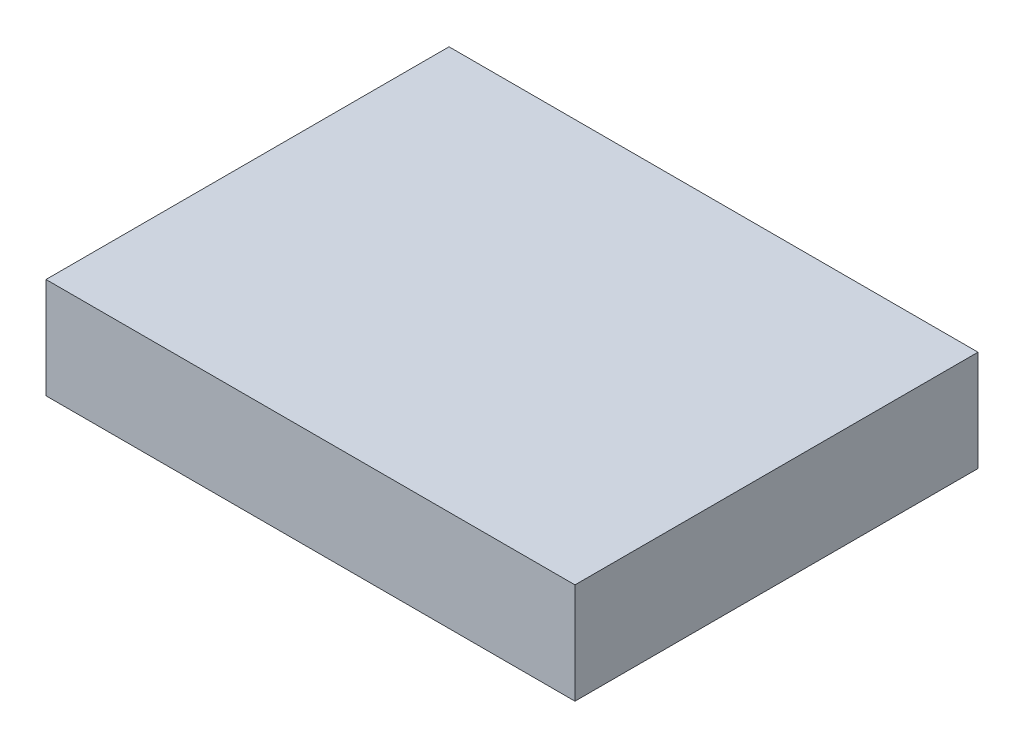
ISO-10303-21;
HEADER;
FILE_DESCRIPTION(('STEP AP214'),'2;1');
FILE_NAME('part.step','',(''),(''),'','','');
FILE_SCHEMA(('AUTOMOTIVE_DESIGN { 1 0 10303 214 1 1 1 1 }'));
ENDSEC;
DATA;
#1=APPLICATION_CONTEXT('core data for automotive mechanical design processes');
#2=APPLICATION_PROTOCOL_DEFINITION('international standard','automotive_design',2000,#1);
#3=PRODUCT_CONTEXT('',#1,'mechanical');
#4=PRODUCT('Part','Part','',(#3));
#5=PRODUCT_RELATED_PRODUCT_CATEGORY('part','',(#4));
#6=PRODUCT_DEFINITION_FORMATION('','',#4);
#7=PRODUCT_DEFINITION_CONTEXT('part definition',#1,'design');
#8=PRODUCT_DEFINITION('design','',#6,#7);
#9=PRODUCT_DEFINITION_SHAPE('','',#8);
#10=(LENGTH_UNIT() NAMED_UNIT(*) SI_UNIT(.MILLI.,.METRE.));
#11=(NAMED_UNIT(*) PLANE_ANGLE_UNIT() SI_UNIT($,.RADIAN.));
#12=(NAMED_UNIT(*) SI_UNIT($,.STERADIAN.) SOLID_ANGLE_UNIT());
#13=UNCERTAINTY_MEASURE_WITH_UNIT(LENGTH_MEASURE(1.E-05),#10,'distance_accuracy_value','');
#14=(GEOMETRIC_REPRESENTATION_CONTEXT(3) GLOBAL_UNCERTAINTY_ASSIGNED_CONTEXT((#13)) GLOBAL_UNIT_ASSIGNED_CONTEXT((#10,
#11,#12)) REPRESENTATION_CONTEXT('',''));
#15=CARTESIAN_POINT('',(0.,0.,0.));
#16=DIRECTION('',(0.,0.,1.));
#17=DIRECTION('',(1.,0.,0.));
#18=AXIS2_PLACEMENT_3D('',#15,#16,#17);
#19=CARTESIAN_POINT('',(-5.25,2.,4.));
#20=DIRECTION('',(-1.,0.,0.));
#21=DIRECTION('',(0.,0.,1.));
#22=AXIS2_PLACEMENT_3D('',#19,#20,#21);
#23=PLANE('',#22);
#24=DIRECTION('',(0.,0.,-1.));
#25=VECTOR('',#24,1.);
#26=CARTESIAN_POINT('',(-5.25,0.,4.));
#27=LINE('',#26,#25);
#28=CARTESIAN_POINT('',(-5.25,0.,4.));
#29=VERTEX_POINT('',#28);
#30=CARTESIAN_POINT('',(-5.25,0.,-4.));
#31=VERTEX_POINT('',#30);
#32=EDGE_CURVE('E222',#29,#31,#27,.T.);
#33=ORIENTED_EDGE('',*,*,#32,.F.);
#34=DIRECTION('',(0.,-1.,0.));
#35=VECTOR('',#34,1.);
#36=CARTESIAN_POINT('',(-5.25,2.,4.));
#37=LINE('',#36,#35);
#38=CARTESIAN_POINT('',(-5.25,2.,4.));
#39=VERTEX_POINT('',#38);
#40=EDGE_CURVE('E11',#39,#29,#37,.T.);
#41=ORIENTED_EDGE('',*,*,#40,.F.);
#42=DIRECTION('',(0.,0.,-1.));
#43=VECTOR('',#42,1.);
#44=CARTESIAN_POINT('',(-5.25,2.,4.));
#45=LINE('',#44,#43);
#46=CARTESIAN_POINT('',(-5.25,2.,-4.));
#47=VERTEX_POINT('',#46);
#48=EDGE_CURVE('E357',#39,#47,#45,.T.);
#49=ORIENTED_EDGE('',*,*,#48,.T.);
#50=DIRECTION('',(0.,-1.,0.));
#51=VECTOR('',#50,1.);
#52=CARTESIAN_POINT('',(-5.25,2.,-4.));
#53=LINE('',#52,#51);
#54=EDGE_CURVE('E41',#47,#31,#53,.T.);
#55=ORIENTED_EDGE('',*,*,#54,.T.);
#56=EDGE_LOOP('',(#33,#41,#49,#55));
#57=FACE_BOUND('',#56,.T.);
#58=ADVANCED_FACE('F38',(#57),#23,.T.);
#59=CARTESIAN_POINT('',(-5.25,2.,4.));
#60=DIRECTION('',(0.,0.,-1.));
#61=DIRECTION('',(-1.,0.,0.));
#62=AXIS2_PLACEMENT_3D('',#59,#60,#61);
#63=PLANE('',#62);
#64=DIRECTION('',(1.,0.,0.));
#65=VECTOR('',#64,1.);
#66=CARTESIAN_POINT('',(-5.25,0.,4.));
#67=LINE('',#66,#65);
#68=CARTESIAN_POINT('',(5.25,0.,4.));
#69=VERTEX_POINT('',#68);
#70=EDGE_CURVE('E362',#29,#69,#67,.T.);
#71=ORIENTED_EDGE('',*,*,#70,.T.);
#72=DIRECTION('',(0.,-1.,0.));
#73=VECTOR('',#72,1.);
#74=CARTESIAN_POINT('',(5.25,2.,4.));
#75=LINE('',#74,#73);
#76=CARTESIAN_POINT('',(5.25,2.,4.));
#77=VERTEX_POINT('',#76);
#78=EDGE_CURVE('E47',#77,#69,#75,.T.);
#79=ORIENTED_EDGE('',*,*,#78,.F.);
#80=DIRECTION('',(1.,0.,0.));
#81=VECTOR('',#80,1.);
#82=CARTESIAN_POINT('',(-5.25,2.,4.));
#83=LINE('',#82,#81);
#84=EDGE_CURVE('E369',#39,#77,#83,.T.);
#85=ORIENTED_EDGE('',*,*,#84,.F.);
#86=ORIENTED_EDGE('',*,*,#40,.T.);
#87=EDGE_LOOP('',(#71,#79,#85,#86));
#88=FACE_BOUND('',#87,.T.);
#89=ADVANCED_FACE('F404',(#88),#63,.F.);
#90=CARTESIAN_POINT('',(5.25,2.,4.));
#91=DIRECTION('',(-1.,0.,0.));
#92=DIRECTION('',(0.,0.,1.));
#93=AXIS2_PLACEMENT_3D('',#90,#91,#92);
#94=PLANE('',#93);
#95=DIRECTION('',(0.,0.,-1.));
#96=VECTOR('',#95,1.);
#97=CARTESIAN_POINT('',(5.25,0.,4.));
#98=LINE('',#97,#96);
#99=CARTESIAN_POINT('',(5.25,0.,-4.));
#100=VERTEX_POINT('',#99);
#101=EDGE_CURVE('E379',#69,#100,#98,.T.);
#102=ORIENTED_EDGE('',*,*,#101,.T.);
#103=DIRECTION('',(0.,-1.,0.));
#104=VECTOR('',#103,1.);
#105=CARTESIAN_POINT('',(5.25,2.,-4.));
#106=LINE('',#105,#104);
#107=CARTESIAN_POINT('',(5.25,2.,-4.));
#108=VERTEX_POINT('',#107);
#109=EDGE_CURVE('E387',#108,#100,#106,.T.);
#110=ORIENTED_EDGE('',*,*,#109,.F.);
#111=DIRECTION('',(0.,0.,-1.));
#112=VECTOR('',#111,1.);
#113=CARTESIAN_POINT('',(5.25,2.,4.));
#114=LINE('',#113,#112);
#115=EDGE_CURVE('E366',#77,#108,#114,.T.);
#116=ORIENTED_EDGE('',*,*,#115,.F.);
#117=ORIENTED_EDGE('',*,*,#78,.T.);
#118=EDGE_LOOP('',(#102,#110,#116,#117));
#119=FACE_BOUND('',#118,.T.);
#120=ADVANCED_FACE('F408',(#119),#94,.F.);
#121=CARTESIAN_POINT('',(-5.25,2.,-4.));
#122=DIRECTION('',(0.,0.,-1.));
#123=DIRECTION('',(-1.,0.,0.));
#124=AXIS2_PLACEMENT_3D('',#121,#122,#123);
#125=PLANE('',#124);
#126=DIRECTION('',(0.,-1.,0.));
#127=VECTOR('',#126,1.);
#128=CARTESIAN_POINT('',(4.375,1.625,-4.));
#129=LINE('',#128,#127);
#130=CARTESIAN_POINT('',(4.375,1.625,-4.));
#131=VERTEX_POINT('',#130);
#132=CARTESIAN_POINT('',(4.375,0.375000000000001,-4.));
#133=VERTEX_POINT('',#132);
#134=EDGE_CURVE('E55',#131,#133,#129,.T.);
#135=ORIENTED_EDGE('',*,*,#134,.F.);
#136=DIRECTION('',(1.,0.,0.));
#137=VECTOR('',#136,1.);
#138=CARTESIAN_POINT('',(4.375,1.625,-4.));
#139=LINE('',#138,#137);
#140=CARTESIAN_POINT('',(3.125,1.625,-4.));
#141=VERTEX_POINT('',#140);
#142=EDGE_CURVE('E199',#141,#131,#139,.T.);
#143=ORIENTED_EDGE('',*,*,#142,.F.);
#144=DIRECTION('',(0.,1.,0.));
#145=VECTOR('',#144,1.);
#146=CARTESIAN_POINT('',(3.125,1.625,-4.));
#147=LINE('',#146,#145);
#148=CARTESIAN_POINT('',(3.125,0.375000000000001,-4.));
#149=VERTEX_POINT('',#148);
#150=EDGE_CURVE('E203',#149,#141,#147,.T.);
#151=ORIENTED_EDGE('',*,*,#150,.F.);
#152=DIRECTION('',(-1.,0.,0.));
#153=VECTOR('',#152,1.);
#154=CARTESIAN_POINT('',(4.375,0.375000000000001,-4.));
#155=LINE('',#154,#153);
#156=EDGE_CURVE('E212',#133,#149,#155,.T.);
#157=ORIENTED_EDGE('',*,*,#156,.F.);
#158=EDGE_LOOP('',(#135,#143,#151,#157));
#159=FACE_BOUND('',#158,.T.);
#160=DIRECTION('',(0.,-1.,0.));
#161=VECTOR('',#160,1.);
#162=CARTESIAN_POINT('',(1.875,1.625,-4.));
#163=LINE('',#162,#161);
#164=CARTESIAN_POINT('',(1.875,1.625,-4.));
#165=VERTEX_POINT('',#164);
#166=CARTESIAN_POINT('',(1.875,0.375000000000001,-4.));
#167=VERTEX_POINT('',#166);
#168=EDGE_CURVE('E63',#165,#167,#163,.T.);
#169=ORIENTED_EDGE('',*,*,#168,.F.);
#170=DIRECTION('',(1.,0.,0.));
#171=VECTOR('',#170,1.);
#172=CARTESIAN_POINT('',(1.875,1.625,-4.));
#173=LINE('',#172,#171);
#174=CARTESIAN_POINT('',(0.625,1.625,-4.));
#175=VERTEX_POINT('',#174);
#176=EDGE_CURVE('E233',#175,#165,#173,.T.);
#177=ORIENTED_EDGE('',*,*,#176,.F.);
#178=DIRECTION('',(0.,1.,0.));
#179=VECTOR('',#178,1.);
#180=CARTESIAN_POINT('',(0.625,1.625,-4.));
#181=LINE('',#180,#179);
#182=CARTESIAN_POINT('',(0.625,0.375000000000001,-4.));
#183=VERTEX_POINT('',#182);
#184=EDGE_CURVE('E253',#183,#175,#181,.T.);
#185=ORIENTED_EDGE('',*,*,#184,.F.);
#186=DIRECTION('',(-1.,0.,0.));
#187=VECTOR('',#186,1.);
#188=CARTESIAN_POINT('',(1.875,0.375000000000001,-4.));
#189=LINE('',#188,#187);
#190=EDGE_CURVE('E248',#167,#183,#189,.T.);
#191=ORIENTED_EDGE('',*,*,#190,.F.);
#192=EDGE_LOOP('',(#169,#177,#185,#191));
#193=FACE_BOUND('',#192,.T.);
#194=DIRECTION('',(1.,0.,0.));
#195=VECTOR('',#194,1.);
#196=CARTESIAN_POINT('',(-1.875,1.625,-4.));
#197=LINE('',#196,#195);
#198=CARTESIAN_POINT('',(-1.875,1.625,-4.));
#199=VERTEX_POINT('',#198);
#200=CARTESIAN_POINT('',(-0.625,1.625,-4.));
#201=VERTEX_POINT('',#200);
#202=EDGE_CURVE('E288',#199,#201,#197,.T.);
#203=ORIENTED_EDGE('',*,*,#202,.F.);
#204=DIRECTION('',(0.,1.,0.));
#205=VECTOR('',#204,1.);
#206=CARTESIAN_POINT('',(-1.875,1.625,-4.));
#207=LINE('',#206,#205);
#208=CARTESIAN_POINT('',(-1.875,0.375000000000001,-4.));
#209=VERTEX_POINT('',#208);
#210=EDGE_CURVE('E275',#209,#199,#207,.T.);
#211=ORIENTED_EDGE('',*,*,#210,.F.);
#212=DIRECTION('',(-1.,0.,0.));
#213=VECTOR('',#212,1.);
#214=CARTESIAN_POINT('',(-1.875,0.375000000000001,-4.));
#215=LINE('',#214,#213);
#216=CARTESIAN_POINT('',(-0.625,0.375000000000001,-4.));
#217=VERTEX_POINT('',#216);
#218=EDGE_CURVE('E296',#217,#209,#215,.T.);
#219=ORIENTED_EDGE('',*,*,#218,.F.);
#220=DIRECTION('',(0.,-1.,0.));
#221=VECTOR('',#220,1.);
#222=CARTESIAN_POINT('',(-0.625,1.625,-4.));
#223=LINE('',#222,#221);
#224=EDGE_CURVE('E291',#201,#217,#223,.T.);
#225=ORIENTED_EDGE('',*,*,#224,.F.);
#226=EDGE_LOOP('',(#203,#211,#219,#225));
#227=FACE_BOUND('',#226,.T.);
#228=DIRECTION('',(1.,0.,0.));
#229=VECTOR('',#228,1.);
#230=CARTESIAN_POINT('',(-4.375,1.625,-4.));
#231=LINE('',#230,#229);
#232=CARTESIAN_POINT('',(-4.375,1.625,-4.));
#233=VERTEX_POINT('',#232);
#234=CARTESIAN_POINT('',(-3.125,1.625,-4.));
#235=VERTEX_POINT('',#234);
#236=EDGE_CURVE('E332',#233,#235,#231,.T.);
#237=ORIENTED_EDGE('',*,*,#236,.F.);
#238=DIRECTION('',(0.,1.,0.));
#239=VECTOR('',#238,1.);
#240=CARTESIAN_POINT('',(-4.375,1.625,-4.));
#241=LINE('',#240,#239);
#242=CARTESIAN_POINT('',(-4.375,0.375000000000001,-4.));
#243=VERTEX_POINT('',#242);
#244=EDGE_CURVE('E319',#243,#233,#241,.T.);
#245=ORIENTED_EDGE('',*,*,#244,.F.);
#246=DIRECTION('',(-1.,0.,0.));
#247=VECTOR('',#246,1.);
#248=CARTESIAN_POINT('',(-4.375,0.375000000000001,-4.));
#249=LINE('',#248,#247);
#250=CARTESIAN_POINT('',(-3.125,0.375000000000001,-4.));
#251=VERTEX_POINT('',#250);
#252=EDGE_CURVE('E339',#251,#243,#249,.T.);
#253=ORIENTED_EDGE('',*,*,#252,.F.);
#254=DIRECTION('',(0.,-1.,0.));
#255=VECTOR('',#254,1.);
#256=CARTESIAN_POINT('',(-3.125,1.625,-4.));
#257=LINE('',#256,#255);
#258=EDGE_CURVE('E335',#235,#251,#257,.T.);
#259=ORIENTED_EDGE('',*,*,#258,.F.);
#260=EDGE_LOOP('',(#237,#245,#253,#259));
#261=FACE_BOUND('',#260,.T.);
#262=DIRECTION('',(1.,0.,0.));
#263=VECTOR('',#262,1.);
#264=CARTESIAN_POINT('',(-5.25,0.,-4.));
#265=LINE('',#264,#263);
#266=EDGE_CURVE('E375',#31,#100,#265,.T.);
#267=ORIENTED_EDGE('',*,*,#266,.F.);
#268=ORIENTED_EDGE('',*,*,#54,.F.);
#269=DIRECTION('',(1.,0.,0.));
#270=VECTOR('',#269,1.);
#271=CARTESIAN_POINT('',(-5.25,2.,-4.));
#272=LINE('',#271,#270);
#273=EDGE_CURVE('E361',#47,#108,#272,.T.);
#274=ORIENTED_EDGE('',*,*,#273,.T.);
#275=ORIENTED_EDGE('',*,*,#109,.T.);
#276=EDGE_LOOP('',(#267,#268,#274,#275));
#277=FACE_BOUND('',#276,.T.);
#278=ADVANCED_FACE('F397',(#159,#193,#227,#261,#277),#125,.T.);
#279=CARTESIAN_POINT('',(0.,2.,0.));
#280=DIRECTION('',(0.,-1.,0.));
#281=DIRECTION('',(0.,0.,-1.));
#282=AXIS2_PLACEMENT_3D('',#279,#280,#281);
#283=PLANE('',#282);
#284=ORIENTED_EDGE('',*,*,#48,.F.);
#285=ORIENTED_EDGE('',*,*,#84,.T.);
#286=ORIENTED_EDGE('',*,*,#115,.T.);
#287=ORIENTED_EDGE('',*,*,#273,.F.);
#288=EDGE_LOOP('',(#284,#285,#286,#287));
#289=FACE_BOUND('',#288,.T.);
#290=ADVANCED_FACE('F410',(#289),#283,.F.);
#291=CARTESIAN_POINT('',(0.,0.,0.));
#292=DIRECTION('',(0.,-1.,0.));
#293=DIRECTION('',(0.,0.,-1.));
#294=AXIS2_PLACEMENT_3D('',#291,#292,#293);
#295=PLANE('',#294);
#296=ORIENTED_EDGE('',*,*,#32,.T.);
#297=ORIENTED_EDGE('',*,*,#266,.T.);
#298=ORIENTED_EDGE('',*,*,#101,.F.);
#299=ORIENTED_EDGE('',*,*,#70,.F.);
#300=EDGE_LOOP('',(#296,#297,#298,#299));
#301=FACE_BOUND('',#300,.T.);
#302=ADVANCED_FACE('F401',(#301),#295,.T.);
#303=CARTESIAN_POINT('',(-4.375,1.625,2.));
#304=DIRECTION('',(0.,1.,0.));
#305=DIRECTION('',(0.,0.,1.));
#306=AXIS2_PLACEMENT_3D('',#303,#304,#305);
#307=PLANE('',#306);
#308=ORIENTED_EDGE('',*,*,#236,.T.);
#309=DIRECTION('',(0.,0.,-1.));
#310=VECTOR('',#309,1.);
#311=CARTESIAN_POINT('',(-3.125,1.625,2.));
#312=LINE('',#311,#310);
#313=CARTESIAN_POINT('',(-3.125,1.625,2.));
#314=VERTEX_POINT('',#313);
#315=EDGE_CURVE('E331',#314,#235,#312,.T.);
#316=ORIENTED_EDGE('',*,*,#315,.F.);
#317=DIRECTION('',(1.,0.,0.));
#318=VECTOR('',#317,1.);
#319=CARTESIAN_POINT('',(-4.375,1.625,2.));
#320=LINE('',#319,#318);
#321=CARTESIAN_POINT('',(-4.375,1.625,2.));
#322=VERTEX_POINT('',#321);
#323=EDGE_CURVE('E314',#322,#314,#320,.T.);
#324=ORIENTED_EDGE('',*,*,#323,.F.);
#325=DIRECTION('',(0.,0.,-1.));
#326=VECTOR('',#325,1.);
#327=CARTESIAN_POINT('',(-4.375,1.625,2.));
#328=LINE('',#327,#326);
#329=EDGE_CURVE('E292',#322,#233,#328,.T.);
#330=ORIENTED_EDGE('',*,*,#329,.T.);
#331=EDGE_LOOP('',(#308,#316,#324,#330));
#332=FACE_BOUND('',#331,.T.);
#333=ADVANCED_FACE('F417',(#332),#307,.F.);
#334=CARTESIAN_POINT('',(-4.375,1.625,2.));
#335=DIRECTION('',(-1.,0.,0.));
#336=DIRECTION('',(0.,0.,1.));
#337=AXIS2_PLACEMENT_3D('',#334,#335,#336);
#338=PLANE('',#337);
#339=ORIENTED_EDGE('',*,*,#244,.T.);
#340=ORIENTED_EDGE('',*,*,#329,.F.);
#341=DIRECTION('',(0.,1.,0.));
#342=VECTOR('',#341,1.);
#343=CARTESIAN_POINT('',(-4.375,1.625,2.));
#344=LINE('',#343,#342);
#345=CARTESIAN_POINT('',(-4.375,0.375000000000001,2.));
#346=VERTEX_POINT('',#345);
#347=EDGE_CURVE('E327',#346,#322,#344,.T.);
#348=ORIENTED_EDGE('',*,*,#347,.F.);
#349=DIRECTION('',(0.,0.,-1.));
#350=VECTOR('',#349,1.);
#351=CARTESIAN_POINT('',(-4.375,0.375000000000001,2.));
#352=LINE('',#351,#350);
#353=EDGE_CURVE('E348',#346,#243,#352,.T.);
#354=ORIENTED_EDGE('',*,*,#353,.T.);
#355=EDGE_LOOP('',(#339,#340,#348,#354));
#356=FACE_BOUND('',#355,.T.);
#357=ADVANCED_FACE('F449',(#356),#338,.F.);
#358=CARTESIAN_POINT('',(-4.375,0.375000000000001,2.));
#359=DIRECTION('',(0.,-1.,0.));
#360=DIRECTION('',(0.,0.,-1.));
#361=AXIS2_PLACEMENT_3D('',#358,#359,#360);
#362=PLANE('',#361);
#363=ORIENTED_EDGE('',*,*,#252,.T.);
#364=ORIENTED_EDGE('',*,*,#353,.F.);
#365=DIRECTION('',(-1.,0.,0.));
#366=VECTOR('',#365,1.);
#367=CARTESIAN_POINT('',(-4.375,0.375000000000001,2.));
#368=LINE('',#367,#366);
#369=CARTESIAN_POINT('',(-3.125,0.375000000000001,2.));
#370=VERTEX_POINT('',#369);
#371=EDGE_CURVE('E323',#370,#346,#368,.T.);
#372=ORIENTED_EDGE('',*,*,#371,.F.);
#373=DIRECTION('',(0.,0.,-1.));
#374=VECTOR('',#373,1.);
#375=CARTESIAN_POINT('',(-3.125,0.375000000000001,2.));
#376=LINE('',#375,#374);
#377=EDGE_CURVE('E351',#370,#251,#376,.T.);
#378=ORIENTED_EDGE('',*,*,#377,.T.);
#379=EDGE_LOOP('',(#363,#364,#372,#378));
#380=FACE_BOUND('',#379,.T.);
#381=ADVANCED_FACE('F458',(#380),#362,.F.);
#382=CARTESIAN_POINT('',(-3.125,1.625,2.));
#383=DIRECTION('',(1.,0.,0.));
#384=DIRECTION('',(0.,0.,-1.));
#385=AXIS2_PLACEMENT_3D('',#382,#383,#384);
#386=PLANE('',#385);
#387=ORIENTED_EDGE('',*,*,#258,.T.);
#388=ORIENTED_EDGE('',*,*,#377,.F.);
#389=DIRECTION('',(0.,-1.,0.));
#390=VECTOR('',#389,1.);
#391=CARTESIAN_POINT('',(-3.125,1.625,2.));
#392=LINE('',#391,#390);
#393=EDGE_CURVE('E318',#314,#370,#392,.T.);
#394=ORIENTED_EDGE('',*,*,#393,.F.);
#395=ORIENTED_EDGE('',*,*,#315,.T.);
#396=EDGE_LOOP('',(#387,#388,#394,#395));
#397=FACE_BOUND('',#396,.T.);
#398=ADVANCED_FACE('F468',(#397),#386,.F.);
#399=CARTESIAN_POINT('',(0.,0.,2.));
#400=DIRECTION('',(0.,0.,-1.));
#401=DIRECTION('',(-1.,0.,0.));
#402=AXIS2_PLACEMENT_3D('',#399,#400,#401);
#403=PLANE('',#402);
#404=ORIENTED_EDGE('',*,*,#323,.T.);
#405=ORIENTED_EDGE('',*,*,#393,.T.);
#406=ORIENTED_EDGE('',*,*,#371,.T.);
#407=ORIENTED_EDGE('',*,*,#347,.T.);
#408=EDGE_LOOP('',(#404,#405,#406,#407));
#409=FACE_BOUND('',#408,.T.);
#410=ADVANCED_FACE('F478',(#409),#403,.T.);
#411=CARTESIAN_POINT('',(-1.875,1.625,2.));
#412=DIRECTION('',(0.,1.,0.));
#413=DIRECTION('',(0.,0.,1.));
#414=AXIS2_PLACEMENT_3D('',#411,#412,#413);
#415=PLANE('',#414);
#416=ORIENTED_EDGE('',*,*,#202,.T.);
#417=DIRECTION('',(0.,0.,-1.));
#418=VECTOR('',#417,1.);
#419=CARTESIAN_POINT('',(-0.625,1.625,2.));
#420=LINE('',#419,#418);
#421=CARTESIAN_POINT('',(-0.625,1.625,2.));
#422=VERTEX_POINT('',#421);
#423=EDGE_CURVE('E287',#422,#201,#420,.T.);
#424=ORIENTED_EDGE('',*,*,#423,.F.);
#425=DIRECTION('',(1.,0.,0.));
#426=VECTOR('',#425,1.);
#427=CARTESIAN_POINT('',(-1.875,1.625,2.));
#428=LINE('',#427,#426);
#429=CARTESIAN_POINT('',(-1.875,1.625,2.));
#430=VERTEX_POINT('',#429);
#431=EDGE_CURVE('E270',#430,#422,#428,.T.);
#432=ORIENTED_EDGE('',*,*,#431,.F.);
#433=DIRECTION('',(0.,0.,-1.));
#434=VECTOR('',#433,1.);
#435=CARTESIAN_POINT('',(-1.875,1.625,2.));
#436=LINE('',#435,#434);
#437=EDGE_CURVE('E249',#430,#199,#436,.T.);
#438=ORIENTED_EDGE('',*,*,#437,.T.);
#439=EDGE_LOOP('',(#416,#424,#432,#438));
#440=FACE_BOUND('',#439,.T.);
#441=ADVANCED_FACE('F488',(#440),#415,.F.);
#442=CARTESIAN_POINT('',(-1.875,1.625,2.));
#443=DIRECTION('',(-1.,0.,0.));
#444=DIRECTION('',(0.,0.,1.));
#445=AXIS2_PLACEMENT_3D('',#442,#443,#444);
#446=PLANE('',#445);
#447=ORIENTED_EDGE('',*,*,#210,.T.);
#448=ORIENTED_EDGE('',*,*,#437,.F.);
#449=DIRECTION('',(0.,1.,0.));
#450=VECTOR('',#449,1.);
#451=CARTESIAN_POINT('',(-1.875,1.625,2.));
#452=LINE('',#451,#450);
#453=CARTESIAN_POINT('',(-1.875,0.375000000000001,2.));
#454=VERTEX_POINT('',#453);
#455=EDGE_CURVE('E283',#454,#430,#452,.T.);
#456=ORIENTED_EDGE('',*,*,#455,.F.);
#457=DIRECTION('',(0.,0.,-1.));
#458=VECTOR('',#457,1.);
#459=CARTESIAN_POINT('',(-1.875,0.375000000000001,2.));
#460=LINE('',#459,#458);
#461=EDGE_CURVE('E305',#454,#209,#460,.T.);
#462=ORIENTED_EDGE('',*,*,#461,.T.);
#463=EDGE_LOOP('',(#447,#448,#456,#462));
#464=FACE_BOUND('',#463,.T.);
#465=ADVANCED_FACE('F498',(#464),#446,.F.);
#466=CARTESIAN_POINT('',(-1.875,0.375000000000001,2.));
#467=DIRECTION('',(0.,-1.,0.));
#468=DIRECTION('',(0.,0.,-1.));
#469=AXIS2_PLACEMENT_3D('',#466,#467,#468);
#470=PLANE('',#469);
#471=ORIENTED_EDGE('',*,*,#218,.T.);
#472=ORIENTED_EDGE('',*,*,#461,.F.);
#473=DIRECTION('',(-1.,0.,0.));
#474=VECTOR('',#473,1.);
#475=CARTESIAN_POINT('',(-1.875,0.375000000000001,2.));
#476=LINE('',#475,#474);
#477=CARTESIAN_POINT('',(-0.625,0.375000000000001,2.));
#478=VERTEX_POINT('',#477);
#479=EDGE_CURVE('E279',#478,#454,#476,.T.);
#480=ORIENTED_EDGE('',*,*,#479,.F.);
#481=DIRECTION('',(0.,0.,-1.));
#482=VECTOR('',#481,1.);
#483=CARTESIAN_POINT('',(-0.625,0.375000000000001,2.));
#484=LINE('',#483,#482);
#485=EDGE_CURVE('E308',#478,#217,#484,.T.);
#486=ORIENTED_EDGE('',*,*,#485,.T.);
#487=EDGE_LOOP('',(#471,#472,#480,#486));
#488=FACE_BOUND('',#487,.T.);
#489=ADVANCED_FACE('F508',(#488),#470,.F.);
#490=CARTESIAN_POINT('',(-0.625,1.625,2.));
#491=DIRECTION('',(1.,0.,0.));
#492=DIRECTION('',(0.,0.,-1.));
#493=AXIS2_PLACEMENT_3D('',#490,#491,#492);
#494=PLANE('',#493);
#495=ORIENTED_EDGE('',*,*,#224,.T.);
#496=ORIENTED_EDGE('',*,*,#485,.F.);
#497=DIRECTION('',(0.,-1.,0.));
#498=VECTOR('',#497,1.);
#499=CARTESIAN_POINT('',(-0.625,1.625,2.));
#500=LINE('',#499,#498);
#501=EDGE_CURVE('E274',#422,#478,#500,.T.);
#502=ORIENTED_EDGE('',*,*,#501,.F.);
#503=ORIENTED_EDGE('',*,*,#423,.T.);
#504=EDGE_LOOP('',(#495,#496,#502,#503));
#505=FACE_BOUND('',#504,.T.);
#506=ADVANCED_FACE('F518',(#505),#494,.F.);
#507=CARTESIAN_POINT('',(0.,0.,2.));
#508=DIRECTION('',(0.,0.,-1.));
#509=DIRECTION('',(-1.,0.,0.));
#510=AXIS2_PLACEMENT_3D('',#507,#508,#509);
#511=PLANE('',#510);
#512=ORIENTED_EDGE('',*,*,#431,.T.);
#513=ORIENTED_EDGE('',*,*,#501,.T.);
#514=ORIENTED_EDGE('',*,*,#479,.T.);
#515=ORIENTED_EDGE('',*,*,#455,.T.);
#516=EDGE_LOOP('',(#512,#513,#514,#515));
#517=FACE_BOUND('',#516,.T.);
#518=ADVANCED_FACE('F528',(#517),#511,.T.);
#519=CARTESIAN_POINT('',(1.875,1.625,2.));
#520=DIRECTION('',(1.,0.,0.));
#521=DIRECTION('',(0.,0.,-1.));
#522=AXIS2_PLACEMENT_3D('',#519,#520,#521);
#523=PLANE('',#522);
#524=ORIENTED_EDGE('',*,*,#168,.T.);
#525=DIRECTION('',(0.,0.,-1.));
#526=VECTOR('',#525,1.);
#527=CARTESIAN_POINT('',(1.875,0.375000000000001,2.));
#528=LINE('',#527,#526);
#529=CARTESIAN_POINT('',(1.875,0.375000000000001,2.));
#530=VERTEX_POINT('',#529);
#531=EDGE_CURVE('E245',#530,#167,#528,.T.);
#532=ORIENTED_EDGE('',*,*,#531,.F.);
#533=DIRECTION('',(0.,-1.,0.));
#534=VECTOR('',#533,1.);
#535=CARTESIAN_POINT('',(1.875,1.625,2.));
#536=LINE('',#535,#534);
#537=CARTESIAN_POINT('',(1.875,1.625,2.));
#538=VERTEX_POINT('',#537);
#539=EDGE_CURVE('E228',#538,#530,#536,.T.);
#540=ORIENTED_EDGE('',*,*,#539,.F.);
#541=DIRECTION('',(0.,0.,-1.));
#542=VECTOR('',#541,1.);
#543=CARTESIAN_POINT('',(1.875,1.625,2.));
#544=LINE('',#543,#542);
#545=EDGE_CURVE('E213',#538,#165,#544,.T.);
#546=ORIENTED_EDGE('',*,*,#545,.T.);
#547=EDGE_LOOP('',(#524,#532,#540,#546));
#548=FACE_BOUND('',#547,.T.);
#549=ADVANCED_FACE('F538',(#548),#523,.F.);
#550=CARTESIAN_POINT('',(1.875,1.625,2.));
#551=DIRECTION('',(0.,1.,0.));
#552=DIRECTION('',(0.,0.,1.));
#553=AXIS2_PLACEMENT_3D('',#550,#551,#552);
#554=PLANE('',#553);
#555=ORIENTED_EDGE('',*,*,#176,.T.);
#556=ORIENTED_EDGE('',*,*,#545,.F.);
#557=DIRECTION('',(1.,0.,0.));
#558=VECTOR('',#557,1.);
#559=CARTESIAN_POINT('',(1.875,1.625,2.));
#560=LINE('',#559,#558);
#561=CARTESIAN_POINT('',(0.625,1.625,2.));
#562=VERTEX_POINT('',#561);
#563=EDGE_CURVE('E241',#562,#538,#560,.T.);
#564=ORIENTED_EDGE('',*,*,#563,.F.);
#565=DIRECTION('',(0.,0.,-1.));
#566=VECTOR('',#565,1.);
#567=CARTESIAN_POINT('',(0.625,1.625,2.));
#568=LINE('',#567,#566);
#569=EDGE_CURVE('E262',#562,#175,#568,.T.);
#570=ORIENTED_EDGE('',*,*,#569,.T.);
#571=EDGE_LOOP('',(#555,#556,#564,#570));
#572=FACE_BOUND('',#571,.T.);
#573=ADVANCED_FACE('F548',(#572),#554,.F.);
#574=CARTESIAN_POINT('',(0.625,1.625,2.));
#575=DIRECTION('',(-1.,0.,0.));
#576=DIRECTION('',(0.,0.,1.));
#577=AXIS2_PLACEMENT_3D('',#574,#575,#576);
#578=PLANE('',#577);
#579=ORIENTED_EDGE('',*,*,#184,.T.);
#580=ORIENTED_EDGE('',*,*,#569,.F.);
#581=DIRECTION('',(0.,1.,0.));
#582=VECTOR('',#581,1.);
#583=CARTESIAN_POINT('',(0.625,1.625,2.));
#584=LINE('',#583,#582);
#585=CARTESIAN_POINT('',(0.625,0.375000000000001,2.));
#586=VERTEX_POINT('',#585);
#587=EDGE_CURVE('E237',#586,#562,#584,.T.);
#588=ORIENTED_EDGE('',*,*,#587,.F.);
#589=DIRECTION('',(0.,0.,-1.));
#590=VECTOR('',#589,1.);
#591=CARTESIAN_POINT('',(0.625,0.375000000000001,2.));
#592=LINE('',#591,#590);
#593=EDGE_CURVE('E265',#586,#183,#592,.T.);
#594=ORIENTED_EDGE('',*,*,#593,.T.);
#595=EDGE_LOOP('',(#579,#580,#588,#594));
#596=FACE_BOUND('',#595,.T.);
#597=ADVANCED_FACE('F557',(#596),#578,.F.);
#598=CARTESIAN_POINT('',(1.875,0.375000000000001,2.));
#599=DIRECTION('',(0.,-1.,0.));
#600=DIRECTION('',(0.,0.,-1.));
#601=AXIS2_PLACEMENT_3D('',#598,#599,#600);
#602=PLANE('',#601);
#603=ORIENTED_EDGE('',*,*,#190,.T.);
#604=ORIENTED_EDGE('',*,*,#593,.F.);
#605=DIRECTION('',(-1.,0.,0.));
#606=VECTOR('',#605,1.);
#607=CARTESIAN_POINT('',(1.875,0.375000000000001,2.));
#608=LINE('',#607,#606);
#609=EDGE_CURVE('E232',#530,#586,#608,.T.);
#610=ORIENTED_EDGE('',*,*,#609,.F.);
#611=ORIENTED_EDGE('',*,*,#531,.T.);
#612=EDGE_LOOP('',(#603,#604,#610,#611));
#613=FACE_BOUND('',#612,.T.);
#614=ADVANCED_FACE('F567',(#613),#602,.F.);
#615=CARTESIAN_POINT('',(0.,0.,2.));
#616=DIRECTION('',(0.,0.,-1.));
#617=DIRECTION('',(-1.,0.,0.));
#618=AXIS2_PLACEMENT_3D('',#615,#616,#617);
#619=PLANE('',#618);
#620=ORIENTED_EDGE('',*,*,#539,.T.);
#621=ORIENTED_EDGE('',*,*,#609,.T.);
#622=ORIENTED_EDGE('',*,*,#587,.T.);
#623=ORIENTED_EDGE('',*,*,#563,.T.);
#624=EDGE_LOOP('',(#620,#621,#622,#623));
#625=FACE_BOUND('',#624,.T.);
#626=ADVANCED_FACE('F577',(#625),#619,.T.);
#627=CARTESIAN_POINT('',(4.375,1.625,2.));
#628=DIRECTION('',(1.,0.,0.));
#629=DIRECTION('',(0.,0.,-1.));
#630=AXIS2_PLACEMENT_3D('',#627,#628,#629);
#631=PLANE('',#630);
#632=ORIENTED_EDGE('',*,*,#134,.T.);
#633=DIRECTION('',(0.,0.,-1.));
#634=VECTOR('',#633,1.);
#635=CARTESIAN_POINT('',(4.375,0.375000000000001,2.));
#636=LINE('',#635,#634);
#637=CARTESIAN_POINT('',(4.375,0.375000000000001,2.));
#638=VERTEX_POINT('',#637);
#639=EDGE_CURVE('E174',#638,#133,#636,.T.);
#640=ORIENTED_EDGE('',*,*,#639,.F.);
#641=DIRECTION('',(0.,-1.,0.));
#642=VECTOR('',#641,1.);
#643=CARTESIAN_POINT('',(4.375,1.625,2.));
#644=LINE('',#643,#642);
#645=CARTESIAN_POINT('',(4.375,1.625,2.));
#646=VERTEX_POINT('',#645);
#647=EDGE_CURVE('E178',#646,#638,#644,.T.);
#648=ORIENTED_EDGE('',*,*,#647,.F.);
#649=DIRECTION('',(0.,0.,-1.));
#650=VECTOR('',#649,1.);
#651=CARTESIAN_POINT('',(4.375,1.625,2.));
#652=LINE('',#651,#650);
#653=EDGE_CURVE('E219',#646,#131,#652,.T.);
#654=ORIENTED_EDGE('',*,*,#653,.T.);
#655=EDGE_LOOP('',(#632,#640,#648,#654));
#656=FACE_BOUND('',#655,.T.);
#657=ADVANCED_FACE('F176',(#656),#631,.F.);
#658=CARTESIAN_POINT('',(4.375,1.625,2.));
#659=DIRECTION('',(0.,1.,0.));
#660=DIRECTION('',(0.,0.,1.));
#661=AXIS2_PLACEMENT_3D('',#658,#659,#660);
#662=PLANE('',#661);
#663=ORIENTED_EDGE('',*,*,#142,.T.);
#664=ORIENTED_EDGE('',*,*,#653,.F.);
#665=DIRECTION('',(1.,0.,0.));
#666=VECTOR('',#665,1.);
#667=CARTESIAN_POINT('',(4.375,1.625,2.));
#668=LINE('',#667,#666);
#669=CARTESIAN_POINT('',(3.125,1.625,2.));
#670=VERTEX_POINT('',#669);
#671=EDGE_CURVE('E185',#670,#646,#668,.T.);
#672=ORIENTED_EDGE('',*,*,#671,.F.);
#673=DIRECTION('',(0.,0.,-1.));
#674=VECTOR('',#673,1.);
#675=CARTESIAN_POINT('',(3.125,1.625,2.));
#676=LINE('',#675,#674);
#677=EDGE_CURVE('E223',#670,#141,#676,.T.);
#678=ORIENTED_EDGE('',*,*,#677,.T.);
#679=EDGE_LOOP('',(#663,#664,#672,#678));
#680=FACE_BOUND('',#679,.T.);
#681=ADVANCED_FACE('F596',(#680),#662,.F.);
#682=CARTESIAN_POINT('',(3.125,1.625,2.));
#683=DIRECTION('',(-1.,0.,0.));
#684=DIRECTION('',(0.,0.,1.));
#685=AXIS2_PLACEMENT_3D('',#682,#683,#684);
#686=PLANE('',#685);
#687=ORIENTED_EDGE('',*,*,#150,.T.);
#688=ORIENTED_EDGE('',*,*,#677,.F.);
#689=DIRECTION('',(0.,1.,0.));
#690=VECTOR('',#689,1.);
#691=CARTESIAN_POINT('',(3.125,1.625,2.));
#692=LINE('',#691,#690);
#693=CARTESIAN_POINT('',(3.125,0.375000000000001,2.));
#694=VERTEX_POINT('',#693);
#695=EDGE_CURVE('E194',#694,#670,#692,.T.);
#696=ORIENTED_EDGE('',*,*,#695,.F.);
#697=DIRECTION('',(0.,0.,-1.));
#698=VECTOR('',#697,1.);
#699=CARTESIAN_POINT('',(3.125,0.375000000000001,2.));
#700=LINE('',#699,#698);
#701=EDGE_CURVE('E184',#694,#149,#700,.T.);
#702=ORIENTED_EDGE('',*,*,#701,.T.);
#703=EDGE_LOOP('',(#687,#688,#696,#702));
#704=FACE_BOUND('',#703,.T.);
#705=ADVANCED_FACE('F605',(#704),#686,.F.);
#706=CARTESIAN_POINT('',(4.375,0.375000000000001,2.));
#707=DIRECTION('',(0.,-1.,0.));
#708=DIRECTION('',(0.,0.,-1.));
#709=AXIS2_PLACEMENT_3D('',#706,#707,#708);
#710=PLANE('',#709);
#711=ORIENTED_EDGE('',*,*,#156,.T.);
#712=ORIENTED_EDGE('',*,*,#701,.F.);
#713=DIRECTION('',(-1.,0.,0.));
#714=VECTOR('',#713,1.);
#715=CARTESIAN_POINT('',(4.375,0.375000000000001,2.));
#716=LINE('',#715,#714);
#717=EDGE_CURVE('E188',#638,#694,#716,.T.);
#718=ORIENTED_EDGE('',*,*,#717,.F.);
#719=ORIENTED_EDGE('',*,*,#639,.T.);
#720=EDGE_LOOP('',(#711,#712,#718,#719));
#721=FACE_BOUND('',#720,.T.);
#722=ADVANCED_FACE('F189',(#721),#710,.F.);
#723=CARTESIAN_POINT('',(0.,0.,2.));
#724=DIRECTION('',(0.,0.,-1.));
#725=DIRECTION('',(-1.,0.,0.));
#726=AXIS2_PLACEMENT_3D('',#723,#724,#725);
#727=PLANE('',#726);
#728=ORIENTED_EDGE('',*,*,#647,.T.);
#729=ORIENTED_EDGE('',*,*,#717,.T.);
#730=ORIENTED_EDGE('',*,*,#695,.T.);
#731=ORIENTED_EDGE('',*,*,#671,.T.);
#732=EDGE_LOOP('',(#728,#729,#730,#731));
#733=FACE_BOUND('',#732,.T.);
#734=ADVANCED_FACE('F196',(#733),#727,.T.);
#735=CLOSED_SHELL('',(#58,#89,#120,#278,#290,#302,#333,#357,#381,#398,#410,#441,#465,#489,#506,
#518,#549,#573,#597,#614,#626,#657,#681,#705,#722,#734));
#736=MANIFOLD_SOLID_BREP('B2',#735);
#737=ADVANCED_BREP_SHAPE_REPRESENTATION('',(#18,#736),#14);
#738=SHAPE_DEFINITION_REPRESENTATION(#9,#737);
ENDSEC;
END-ISO-10303-21;
